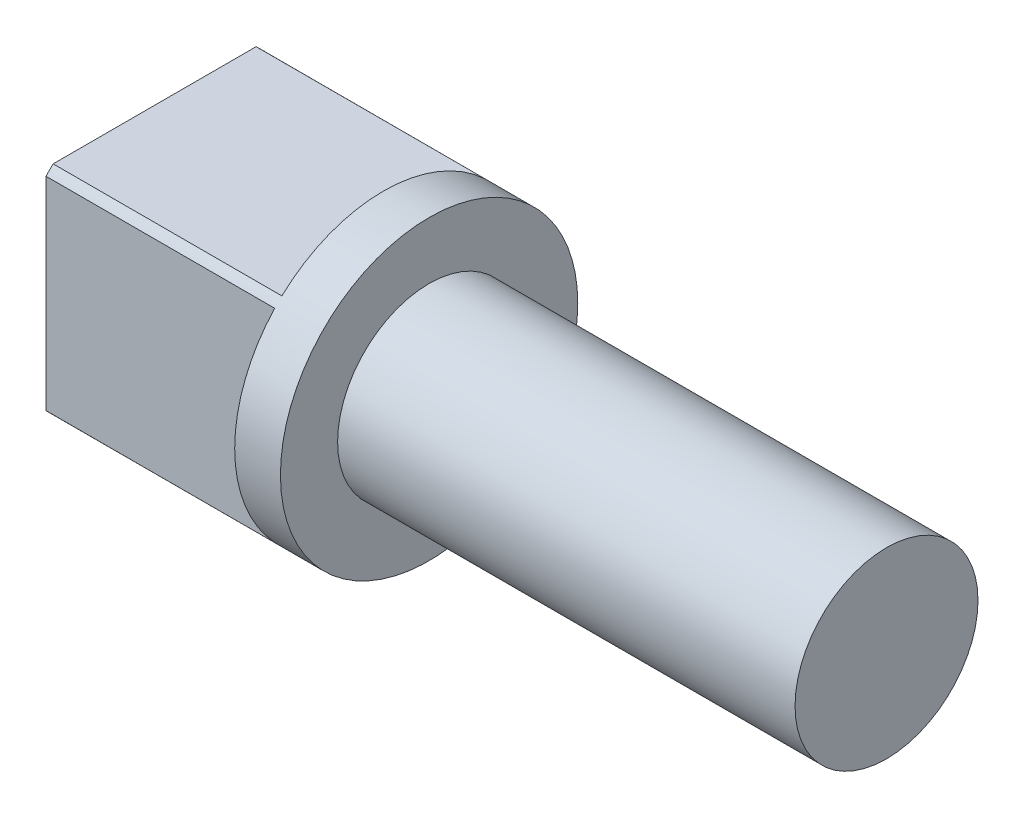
ISO-10303-21;
HEADER;
FILE_DESCRIPTION(('STEP AP214'),'2;1');
FILE_NAME('part.step','',(''),(''),'','','');
FILE_SCHEMA(('AUTOMOTIVE_DESIGN { 1 0 10303 214 1 1 1 1 }'));
ENDSEC;
DATA;
#1=APPLICATION_CONTEXT('core data for automotive mechanical design processes');
#2=APPLICATION_PROTOCOL_DEFINITION('international standard','automotive_design',2000,#1);
#3=PRODUCT_CONTEXT('',#1,'mechanical');
#4=PRODUCT('Part','Part','',(#3));
#5=PRODUCT_RELATED_PRODUCT_CATEGORY('part','',(#4));
#6=PRODUCT_DEFINITION_FORMATION('','',#4);
#7=PRODUCT_DEFINITION_CONTEXT('part definition',#1,'design');
#8=PRODUCT_DEFINITION('design','',#6,#7);
#9=PRODUCT_DEFINITION_SHAPE('','',#8);
#10=(LENGTH_UNIT() NAMED_UNIT(*) SI_UNIT(.MILLI.,.METRE.));
#11=(NAMED_UNIT(*) PLANE_ANGLE_UNIT() SI_UNIT($,.RADIAN.));
#12=(NAMED_UNIT(*) SI_UNIT($,.STERADIAN.) SOLID_ANGLE_UNIT());
#13=UNCERTAINTY_MEASURE_WITH_UNIT(LENGTH_MEASURE(1.E-05),#10,'distance_accuracy_value','');
#14=(GEOMETRIC_REPRESENTATION_CONTEXT(3) GLOBAL_UNCERTAINTY_ASSIGNED_CONTEXT((#13)) GLOBAL_UNIT_ASSIGNED_CONTEXT((#10,
#11,#12)) REPRESENTATION_CONTEXT('',''));
#15=CARTESIAN_POINT('',(0.,0.,0.));
#16=DIRECTION('',(0.,0.,1.));
#17=DIRECTION('',(1.,0.,0.));
#18=AXIS2_PLACEMENT_3D('',#15,#16,#17);
#19=CARTESIAN_POINT('',(0.,0.,0.));
#20=DIRECTION('',(1.,0.,0.));
#21=DIRECTION('',(0.,0.,-1.));
#22=AXIS2_PLACEMENT_3D('',#19,#20,#21);
#23=PLANE('',#22);
#24=DIRECTION('',(0.,-1.,0.));
#25=VECTOR('',#24,1.);
#26=CARTESIAN_POINT('',(0.,-4.43705983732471,-4.75));
#27=LINE('',#26,#25);
#28=CARTESIAN_POINT('',(0.,4.43705983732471,-4.75));
#29=VERTEX_POINT('',#28);
#30=CARTESIAN_POINT('',(0.,-4.43705983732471,-4.75));
#31=VERTEX_POINT('',#30);
#32=EDGE_CURVE('E118',#29,#31,#27,.T.);
#33=ORIENTED_EDGE('',*,*,#32,.F.);
#34=CARTESIAN_POINT('',(0.,0.,0.));
#35=DIRECTION('',(1.,0.,0.));
#36=DIRECTION('',(0.,0.,-1.));
#37=AXIS2_PLACEMENT_3D('',#34,#35,#36);
#38=CIRCLE('',#37,6.5);
#39=EDGE_CURVE('E48',#31,#29,#38,.T.);
#40=ORIENTED_EDGE('',*,*,#39,.F.);
#41=EDGE_LOOP('',(#33,#40));
#42=FACE_BOUND('',#41,.T.);
#43=ADVANCED_FACE('F32',(#42),#23,.F.);
#44=DIRECTION('',(0.,0.,-1.));
#45=VECTOR('',#44,1.);
#46=CARTESIAN_POINT('',(0.,4.75,4.43705983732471));
#47=LINE('',#46,#45);
#48=CARTESIAN_POINT('',(0.,4.75,4.43705983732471));
#49=VERTEX_POINT('',#48);
#50=CARTESIAN_POINT('',(0.,4.75,-4.43705983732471));
#51=VERTEX_POINT('',#50);
#52=EDGE_CURVE('E135',#49,#51,#47,.T.);
#53=ORIENTED_EDGE('',*,*,#52,.F.);
#54=EDGE_CURVE('E41',#51,#49,#38,.T.);
#55=ORIENTED_EDGE('',*,*,#54,.F.);
#56=EDGE_LOOP('',(#53,#55));
#57=FACE_BOUND('',#56,.T.);
#58=ADVANCED_FACE('F207',(#57),#23,.F.);
#59=DIRECTION('',(0.,1.,0.));
#60=VECTOR('',#59,1.);
#61=CARTESIAN_POINT('',(0.,-4.43705983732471,4.75));
#62=LINE('',#61,#60);
#63=CARTESIAN_POINT('',(0.,-4.43705983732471,4.75));
#64=VERTEX_POINT('',#63);
#65=CARTESIAN_POINT('',(0.,4.43705983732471,4.75));
#66=VERTEX_POINT('',#65);
#67=EDGE_CURVE('E172',#64,#66,#62,.T.);
#68=ORIENTED_EDGE('',*,*,#67,.F.);
#69=EDGE_CURVE('E154',#66,#64,#38,.T.);
#70=ORIENTED_EDGE('',*,*,#69,.F.);
#71=EDGE_LOOP('',(#68,#70));
#72=FACE_BOUND('',#71,.T.);
#73=ADVANCED_FACE('F209',(#72),#23,.F.);
#74=DIRECTION('',(0.,0.,1.));
#75=VECTOR('',#74,1.);
#76=CARTESIAN_POINT('',(0.,-4.75,4.43705983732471));
#77=LINE('',#76,#75);
#78=CARTESIAN_POINT('',(0.,-4.75,-4.43705983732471));
#79=VERTEX_POINT('',#78);
#80=CARTESIAN_POINT('',(0.,-4.75,4.43705983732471));
#81=VERTEX_POINT('',#80);
#82=EDGE_CURVE('E55',#79,#81,#77,.T.);
#83=ORIENTED_EDGE('',*,*,#82,.F.);
#84=EDGE_CURVE('E120',#81,#79,#38,.T.);
#85=ORIENTED_EDGE('',*,*,#84,.F.);
#86=EDGE_LOOP('',(#83,#85));
#87=FACE_BOUND('',#86,.T.);
#88=ADVANCED_FACE('F214',(#87),#23,.F.);
#89=CARTESIAN_POINT('',(2.,0.,0.));
#90=DIRECTION('',(-1.,0.,0.));
#91=DIRECTION('',(0.,0.,1.));
#92=AXIS2_PLACEMENT_3D('',#89,#90,#91);
#93=CYLINDRICAL_SURFACE('',#92,6.5);
#94=CARTESIAN_POINT('',(2.,0.,0.));
#95=DIRECTION('',(1.,0.,0.));
#96=DIRECTION('',(0.,0.,-1.));
#97=AXIS2_PLACEMENT_3D('',#94,#95,#96);
#98=CIRCLE('',#97,6.5);
#99=CARTESIAN_POINT('',(2.,0.,-6.5));
#100=VERTEX_POINT('',#99);
#101=EDGE_CURVE('E11',#100,#100,#98,.T.);
#102=ORIENTED_EDGE('',*,*,#101,.F.);
#103=EDGE_LOOP('',(#102));
#104=FACE_BOUND('',#103,.T.);
#105=ORIENTED_EDGE('',*,*,#39,.T.);
#106=DIRECTION('',(1.,0.,0.));
#107=VECTOR('',#106,1.);
#108=CARTESIAN_POINT('',(-10.,4.43705983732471,-4.75));
#109=LINE('',#108,#107);
#110=CARTESIAN_POINT('',(-10.,4.43705983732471,-4.75));
#111=VERTEX_POINT('',#110);
#112=EDGE_CURVE('E159',#111,#29,#109,.T.);
#113=ORIENTED_EDGE('',*,*,#112,.F.);
#114=CARTESIAN_POINT('',(-10.,0.,0.));
#115=DIRECTION('',(-1.,0.,0.));
#116=DIRECTION('',(0.,0.,1.));
#117=AXIS2_PLACEMENT_3D('',#114,#115,#116);
#118=CIRCLE('',#117,6.5);
#119=CARTESIAN_POINT('',(-10.,4.75,-4.43705983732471));
#120=VERTEX_POINT('',#119);
#121=EDGE_CURVE('E199',#120,#111,#118,.T.);
#122=ORIENTED_EDGE('',*,*,#121,.F.);
#123=DIRECTION('',(1.,0.,0.));
#124=VECTOR('',#123,1.);
#125=CARTESIAN_POINT('',(-10.,4.75,-4.43705983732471));
#126=LINE('',#125,#124);
#127=EDGE_CURVE('E162',#120,#51,#126,.T.);
#128=ORIENTED_EDGE('',*,*,#127,.T.);
#129=ORIENTED_EDGE('',*,*,#54,.T.);
#130=DIRECTION('',(1.,0.,0.));
#131=VECTOR('',#130,1.);
#132=CARTESIAN_POINT('',(-10.,4.75,4.43705983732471));
#133=LINE('',#132,#131);
#134=CARTESIAN_POINT('',(-10.,4.75,4.43705983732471));
#135=VERTEX_POINT('',#134);
#136=EDGE_CURVE('E165',#135,#49,#133,.T.);
#137=ORIENTED_EDGE('',*,*,#136,.F.);
#138=CARTESIAN_POINT('',(-10.,0.,0.));
#139=DIRECTION('',(-1.,0.,0.));
#140=DIRECTION('',(0.,0.,1.));
#141=AXIS2_PLACEMENT_3D('',#138,#139,#140);
#142=CIRCLE('',#141,6.5);
#143=CARTESIAN_POINT('',(-10.,4.43705983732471,4.75));
#144=VERTEX_POINT('',#143);
#145=EDGE_CURVE('E194',#144,#135,#142,.T.);
#146=ORIENTED_EDGE('',*,*,#145,.F.);
#147=DIRECTION('',(1.,0.,0.));
#148=VECTOR('',#147,1.);
#149=CARTESIAN_POINT('',(-10.,4.43705983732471,4.75));
#150=LINE('',#149,#148);
#151=EDGE_CURVE('E178',#144,#66,#150,.T.);
#152=ORIENTED_EDGE('',*,*,#151,.T.);
#153=ORIENTED_EDGE('',*,*,#69,.T.);
#154=DIRECTION('',(1.,0.,0.));
#155=VECTOR('',#154,1.);
#156=CARTESIAN_POINT('',(-10.,-4.43705983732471,4.75));
#157=LINE('',#156,#155);
#158=CARTESIAN_POINT('',(-10.,-4.43705983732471,4.75));
#159=VERTEX_POINT('',#158);
#160=EDGE_CURVE('E126',#159,#64,#157,.T.);
#161=ORIENTED_EDGE('',*,*,#160,.F.);
#162=CARTESIAN_POINT('',(-10.,0.,0.));
#163=DIRECTION('',(-1.,0.,0.));
#164=DIRECTION('',(0.,0.,1.));
#165=AXIS2_PLACEMENT_3D('',#162,#163,#164);
#166=CIRCLE('',#165,6.5);
#167=CARTESIAN_POINT('',(-10.,-4.75,4.43705983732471));
#168=VERTEX_POINT('',#167);
#169=EDGE_CURVE('E108',#168,#159,#166,.T.);
#170=ORIENTED_EDGE('',*,*,#169,.F.);
#171=DIRECTION('',(1.,0.,0.));
#172=VECTOR('',#171,1.);
#173=CARTESIAN_POINT('',(-10.,-4.75,4.43705983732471));
#174=LINE('',#173,#172);
#175=EDGE_CURVE('E105',#168,#81,#174,.T.);
#176=ORIENTED_EDGE('',*,*,#175,.T.);
#177=ORIENTED_EDGE('',*,*,#84,.T.);
#178=DIRECTION('',(1.,0.,0.));
#179=VECTOR('',#178,1.);
#180=CARTESIAN_POINT('',(-10.,-4.75,-4.43705983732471));
#181=LINE('',#180,#179);
#182=CARTESIAN_POINT('',(-10.,-4.75,-4.43705983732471));
#183=VERTEX_POINT('',#182);
#184=EDGE_CURVE('E103',#183,#79,#181,.T.);
#185=ORIENTED_EDGE('',*,*,#184,.F.);
#186=CARTESIAN_POINT('',(-10.,0.,0.));
#187=DIRECTION('',(-1.,0.,0.));
#188=DIRECTION('',(0.,0.,1.));
#189=AXIS2_PLACEMENT_3D('',#186,#187,#188);
#190=CIRCLE('',#189,6.5);
#191=CARTESIAN_POINT('',(-10.,-4.43705983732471,-4.75));
#192=VERTEX_POINT('',#191);
#193=EDGE_CURVE('E109',#192,#183,#190,.T.);
#194=ORIENTED_EDGE('',*,*,#193,.F.);
#195=DIRECTION('',(1.,0.,0.));
#196=VECTOR('',#195,1.);
#197=CARTESIAN_POINT('',(-10.,-4.43705983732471,-4.75));
#198=LINE('',#197,#196);
#199=EDGE_CURVE('E136',#192,#31,#198,.T.);
#200=ORIENTED_EDGE('',*,*,#199,.T.);
#201=EDGE_LOOP('',(#105,#113,#122,#128,#129,#137,#146,#152,#153,#161,#170,#176,#177,#185,#194,#200));
#202=FACE_BOUND('',#201,.T.);
#203=ADVANCED_FACE('F34',(#104,#202),#93,.T.);
#204=CARTESIAN_POINT('',(2.,0.,0.));
#205=DIRECTION('',(1.,0.,0.));
#206=DIRECTION('',(0.,0.,-1.));
#207=AXIS2_PLACEMENT_3D('',#204,#205,#206);
#208=PLANE('',#207);
#209=CARTESIAN_POINT('',(2.,0.,0.));
#210=DIRECTION('',(1.,0.,0.));
#211=DIRECTION('',(0.,0.,-1.));
#212=AXIS2_PLACEMENT_3D('',#209,#210,#211);
#213=CIRCLE('',#212,4.);
#214=CARTESIAN_POINT('',(2.,0.,-4.));
#215=VERTEX_POINT('',#214);
#216=EDGE_CURVE('E121',#215,#215,#213,.T.);
#217=ORIENTED_EDGE('',*,*,#216,.F.);
#218=EDGE_LOOP('',(#217));
#219=FACE_BOUND('',#218,.T.);
#220=ORIENTED_EDGE('',*,*,#101,.T.);
#221=EDGE_LOOP('',(#220));
#222=FACE_BOUND('',#221,.T.);
#223=ADVANCED_FACE('F217',(#219,#222),#208,.T.);
#224=CARTESIAN_POINT('',(22.,0.,0.));
#225=DIRECTION('',(-1.,0.,0.));
#226=DIRECTION('',(0.,0.,1.));
#227=AXIS2_PLACEMENT_3D('',#224,#225,#226);
#228=CYLINDRICAL_SURFACE('',#227,4.);
#229=CARTESIAN_POINT('',(22.,0.,0.));
#230=DIRECTION('',(1.,0.,0.));
#231=DIRECTION('',(0.,0.,-1.));
#232=AXIS2_PLACEMENT_3D('',#229,#230,#231);
#233=CIRCLE('',#232,4.);
#234=CARTESIAN_POINT('',(22.,0.,-4.));
#235=VERTEX_POINT('',#234);
#236=EDGE_CURVE('E124',#235,#235,#233,.T.);
#237=ORIENTED_EDGE('',*,*,#236,.F.);
#238=EDGE_LOOP('',(#237));
#239=FACE_BOUND('',#238,.T.);
#240=ORIENTED_EDGE('',*,*,#216,.T.);
#241=EDGE_LOOP('',(#240));
#242=FACE_BOUND('',#241,.T.);
#243=ADVANCED_FACE('F220',(#239,#242),#228,.T.);
#244=CARTESIAN_POINT('',(22.,0.,0.));
#245=DIRECTION('',(1.,0.,0.));
#246=DIRECTION('',(0.,0.,-1.));
#247=AXIS2_PLACEMENT_3D('',#244,#245,#246);
#248=PLANE('',#247);
#249=ORIENTED_EDGE('',*,*,#236,.T.);
#250=EDGE_LOOP('',(#249));
#251=FACE_BOUND('',#250,.T.);
#252=ADVANCED_FACE('F224',(#251),#248,.T.);
#253=CARTESIAN_POINT('',(-10.,-4.75,4.43705983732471));
#254=DIRECTION('',(0.,1.,0.));
#255=DIRECTION('',(0.,0.,1.));
#256=AXIS2_PLACEMENT_3D('',#253,#254,#255);
#257=PLANE('',#256);
#258=ORIENTED_EDGE('',*,*,#82,.T.);
#259=ORIENTED_EDGE('',*,*,#175,.F.);
#260=DIRECTION('',(0.,0.,1.));
#261=VECTOR('',#260,1.);
#262=CARTESIAN_POINT('',(-10.,-4.75,4.43705983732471));
#263=LINE('',#262,#261);
#264=EDGE_CURVE('E99',#183,#168,#263,.T.);
#265=ORIENTED_EDGE('',*,*,#264,.F.);
#266=ORIENTED_EDGE('',*,*,#184,.T.);
#267=EDGE_LOOP('',(#258,#259,#265,#266));
#268=FACE_BOUND('',#267,.T.);
#269=ADVANCED_FACE('F101',(#268),#257,.F.);
#270=CARTESIAN_POINT('',(-10.,-4.43705983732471,4.75));
#271=DIRECTION('',(0.,0.,-1.));
#272=DIRECTION('',(-1.,0.,0.));
#273=AXIS2_PLACEMENT_3D('',#270,#271,#272);
#274=PLANE('',#273);
#275=ORIENTED_EDGE('',*,*,#67,.T.);
#276=ORIENTED_EDGE('',*,*,#151,.F.);
#277=DIRECTION('',(0.,1.,0.));
#278=VECTOR('',#277,1.);
#279=CARTESIAN_POINT('',(-10.,-4.43705983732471,4.75));
#280=LINE('',#279,#278);
#281=EDGE_CURVE('E192',#159,#144,#280,.T.);
#282=ORIENTED_EDGE('',*,*,#281,.F.);
#283=ORIENTED_EDGE('',*,*,#160,.T.);
#284=EDGE_LOOP('',(#275,#276,#282,#283));
#285=FACE_BOUND('',#284,.T.);
#286=ADVANCED_FACE('F231',(#285),#274,.F.);
#287=CARTESIAN_POINT('',(-10.,4.75,4.43705983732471));
#288=DIRECTION('',(0.,-1.,0.));
#289=DIRECTION('',(0.,0.,-1.));
#290=AXIS2_PLACEMENT_3D('',#287,#288,#289);
#291=PLANE('',#290);
#292=ORIENTED_EDGE('',*,*,#52,.T.);
#293=ORIENTED_EDGE('',*,*,#127,.F.);
#294=DIRECTION('',(0.,0.,-1.));
#295=VECTOR('',#294,1.);
#296=CARTESIAN_POINT('',(-10.,4.75,4.43705983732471));
#297=LINE('',#296,#295);
#298=EDGE_CURVE('E198',#135,#120,#297,.T.);
#299=ORIENTED_EDGE('',*,*,#298,.F.);
#300=ORIENTED_EDGE('',*,*,#136,.T.);
#301=EDGE_LOOP('',(#292,#293,#299,#300));
#302=FACE_BOUND('',#301,.T.);
#303=ADVANCED_FACE('F205',(#302),#291,.F.);
#304=CARTESIAN_POINT('',(-10.,-4.43705983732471,-4.75));
#305=DIRECTION('',(0.,0.,1.));
#306=DIRECTION('',(1.,0.,0.));
#307=AXIS2_PLACEMENT_3D('',#304,#305,#306);
#308=PLANE('',#307);
#309=ORIENTED_EDGE('',*,*,#32,.T.);
#310=ORIENTED_EDGE('',*,*,#199,.F.);
#311=DIRECTION('',(0.,-1.,0.));
#312=VECTOR('',#311,1.);
#313=CARTESIAN_POINT('',(-10.,-4.43705983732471,-4.75));
#314=LINE('',#313,#312);
#315=EDGE_CURVE('E114',#111,#192,#314,.T.);
#316=ORIENTED_EDGE('',*,*,#315,.F.);
#317=ORIENTED_EDGE('',*,*,#112,.T.);
#318=EDGE_LOOP('',(#309,#310,#316,#317));
#319=FACE_BOUND('',#318,.T.);
#320=ADVANCED_FACE('F161',(#319),#308,.F.);
#321=CARTESIAN_POINT('',(-10.,0.,0.));
#322=DIRECTION('',(-1.,0.,0.));
#323=DIRECTION('',(0.,0.,1.));
#324=AXIS2_PLACEMENT_3D('',#321,#322,#323);
#325=PLANE('',#324);
#326=ORIENTED_EDGE('',*,*,#193,.T.);
#327=ORIENTED_EDGE('',*,*,#264,.T.);
#328=ORIENTED_EDGE('',*,*,#169,.T.);
#329=ORIENTED_EDGE('',*,*,#281,.T.);
#330=ORIENTED_EDGE('',*,*,#145,.T.);
#331=ORIENTED_EDGE('',*,*,#298,.T.);
#332=ORIENTED_EDGE('',*,*,#121,.T.);
#333=ORIENTED_EDGE('',*,*,#315,.T.);
#334=EDGE_LOOP('',(#326,#327,#328,#329,#330,#331,#332,#333));
#335=FACE_BOUND('',#334,.T.);
#336=ADVANCED_FACE('F112',(#335),#325,.T.);
#337=CLOSED_SHELL('',(#43,#58,#73,#88,#203,#223,#243,#252,#269,#286,#303,#320,#336));
#338=MANIFOLD_SOLID_BREP('B2',#337);
#339=ADVANCED_BREP_SHAPE_REPRESENTATION('',(#18,#338),#14);
#340=SHAPE_DEFINITION_REPRESENTATION(#9,#339);
ENDSEC;
END-ISO-10303-21;
